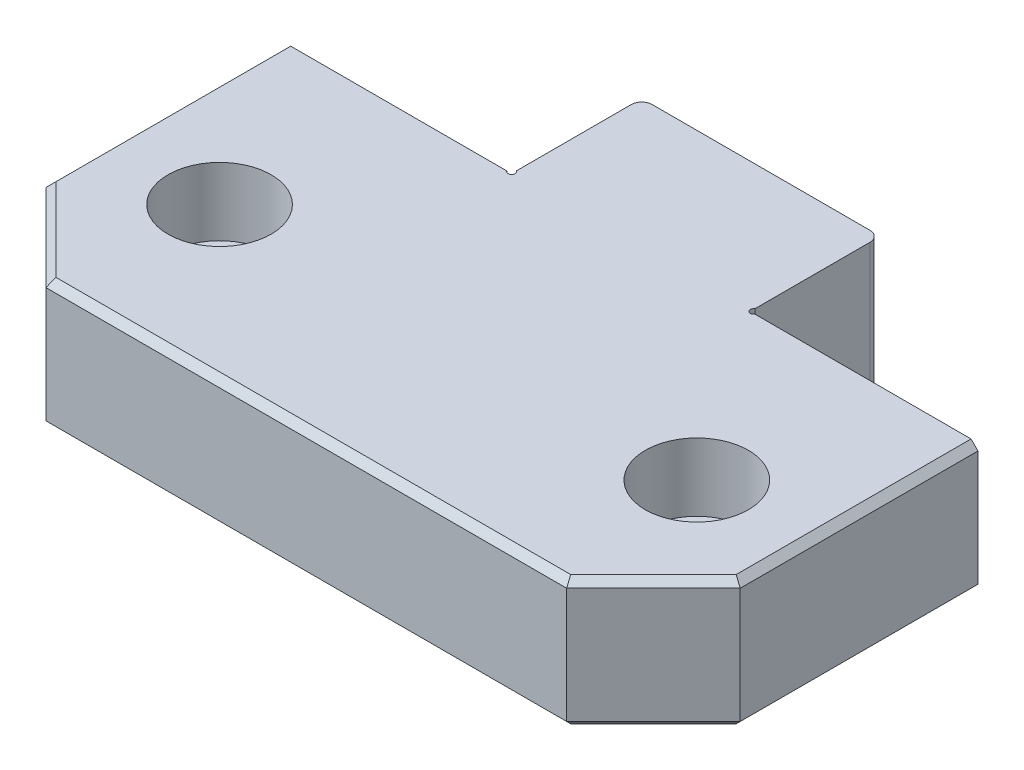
from build123d import *

# Parameters (mm, degrees)
EXTRUDE1_DEPTH     = 18.923
CHAMFER1_SIZE      = 12.7
SKETCH4_R          = 5.1562
CUT_EXTRUDE2_DEPTH = 15.748
CUT_EXTRUDE3_START = -18.923
SKETCH5_R          = 7.5438
CUT_EXTRUDE3_DEPTH = 9.9314
FILLET2_R          = 1.524
CHAMFER3_SIZE      = 1.016
SKETCH6_W          = 34.925
SKETCH6_H          = 19.05
EXTRUDE2_DEPTH     = 0.254


with BuildPart() as part:
    # Sketch2 → Extrude1 (new body)
    with BuildSketch(Plane(origin=(0, 0, 0), x_dir=(1, 0, 0), z_dir=(0, 1, 0))):
        with BuildLine():
            Line((-17.4625, 0.693940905), (-17.4625, 19.05))
            Line((-17.4625, 19.05), (17.4625, 19.05))
            Line((17.4625, 19.05), (17.4625, 0.686191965))
            ThreePointArc((17.4625, 0.686191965), (17.362024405, -0.100475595), (18.148691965, 0))
            Line((18.148691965, 0), (50.8, 0))
            Line((50.8, 0), (50.8, -47.498))
            Line((50.8, -47.498), (-50.8, -47.498))
            Line((-50.8, -47.498), (-50.8, 0))
            Line((-50.8, 0), (-18.156440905, 0))
            ThreePointArc((-18.156440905, 0), (-17.357289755, -0.105210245), (-17.4625, 0.693940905))
        make_face()
    extrude(amount=EXTRUDE1_DEPTH)

    # Chamfer1
    chamfer1_edges = [part.edges().sort_by_distance(p)[0] for p in [
        (50.8, 9.4615, 47.498),
        (-50.8, 9.4615, 47.498),
    ]]
    chamfer(chamfer1_edges, length=CHAMFER1_SIZE)

    # Sketch4 → Cut-Extrude2 (cut)
    with BuildSketch(Plane.XZ):
        with Locations(Location((34.925, 25.273, 0), (0, 0, 270))):
            Circle(SKETCH4_R)
        with Locations(Location((-34.925, 25.273, 0), (0, 0, 270))):
            Circle(SKETCH4_R)
    extrude(amount=-CUT_EXTRUDE2_DEPTH, mode=Mode.SUBTRACT)

    # Sketch5 → Cut-Extrude3 (cut)
    with BuildSketch(Plane.XZ.offset(CUT_EXTRUDE3_START)):
        with Locations(Location((34.925, 25.273, 0), (0, 0, 90))):
            Circle(SKETCH5_R)
        with Locations(Location((-34.925, 25.273, 0), (0, 0, 90))):
            Circle(SKETCH5_R)
    extrude(amount=CUT_EXTRUDE3_DEPTH, mode=Mode.SUBTRACT)

    # Fillet2
    fillet2_edges = [part.edges().sort_by_distance(p)[0] for p in [
        (-17.4625, 9.4615, -19.05),
        (17.4625, 9.4615, -19.05),
    ]]
    fillet(fillet2_edges, radius=FILLET2_R)

    # Chamfer3
    chamfer3_edges = [part.edges().sort_by_distance(p)[0] for p in [
        (-50.8, 0, 17.399),
        (50.8, 0, 17.399),
        (50.8, 18.923, 17.399),
        (0, 0, 47.498),
        (-44.45, 0, 41.148),
        (44.45, 0, 41.148),
        (0, 18.923, 47.498),
        (-44.45, 18.923, 41.148),
        (44.45, 18.923, 41.148),
        (-50.8, 18.923, 17.399),
    ]]
    chamfer(chamfer3_edges, length=CHAMFER3_SIZE)

    # Sketch6 → Extrude2 (cut)
    with BuildSketch(Plane.XZ):
        with Locations((0, -9.525)):
            Rectangle(SKETCH6_W, SKETCH6_H)
    extrude(amount=-EXTRUDE2_DEPTH, mode=Mode.SUBTRACT)


solid = part.part
